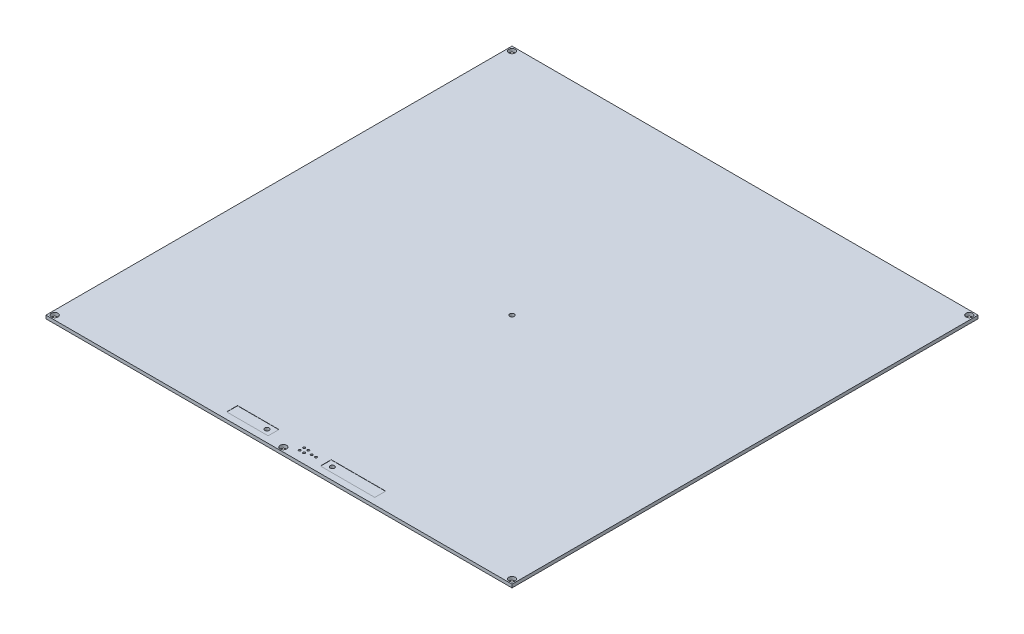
from build123d import *

# Parameters (mm, degrees)
SKIZZE1_W                       = 214
SKIZZE1_H                       = 214
AUFSATZ_LINEAR_AUSTRAGEN1_DEPTH = 1.5
SKIZZE2_R                       = 1.5
SCHNITT_LINEAR_AUSTRAGEN1_DEPTH = 152.328285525
SPIEGELN2_COPY_1_SKETCH_R       = 1.5
SPIEGELN2_COPY_1_DEPTH          = 152.328285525
SKIZZE3_R                       = 1.5
SKIZZE3_R_2                     = 1
SKIZZE3_R_3                     = 0.5
SKIZZE3_R_4                     = 1.05
SCHNITT_LINEAR_AUSTRAGEN2_DEPTH = 152.328285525
SKIZZE4_W                       = 19.050649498
SKIZZE4_H                       = 5
SKIZZE4_W_2                     = 25
SCHNITT_LINEAR_AUSTRAGEN3_DEPTH = 0.1


with BuildPart() as part:
    # Skizze1 → Aufsatz-Linear austragen1 (new body)
    with BuildSketch(Plane(origin=(0, 0, 0), x_dir=(1, 0, 0), z_dir=(0, 1, 0))):
        Rectangle(SKIZZE1_W, SKIZZE1_H)
    extrude(amount=AUFSATZ_LINEAR_AUSTRAGEN1_DEPTH)

    # Skizze2 → Schnitt-Linear austragen1 (cut, through all)
    with BuildSketch(Plane(origin=(0, 1.5, 0), x_dir=(1, 0, 0), z_dir=(0, 1, 0))):
        with Locations(Location((-105, 105, 0), (0, 0, 270))):
            Circle(SKIZZE2_R)
    schnitt_linear_austragen1 = extrude(amount=-SCHNITT_LINEAR_AUSTRAGEN1_DEPTH, mode=Mode.SUBTRACT)

    # Spiegeln1: Schnitt-Linear austragen1 across plane
    add(schnitt_linear_austragen1.mirror(Plane.XY), mode=Mode.SUBTRACT)

    # Spiegeln2: Schnitt-Linear austragen1 across plane
    add(schnitt_linear_austragen1.mirror(Plane(origin=(0, 0, 0), x_dir=(0, 0, 1), z_dir=(1, 0, 0))), mode=Mode.SUBTRACT)

    # Spiegeln2 copy 1 sketch → Spiegeln2 copy 1 (cut, through all)
    with BuildSketch(Plane(origin=(0, 1.5, 0), x_dir=(-1, 0, 0), z_dir=(0, 1, 0))):
        with Locations(Location((-105, 105, 0), (0, 0, 270))):
            Circle(SPIEGELN2_COPY_1_SKETCH_R)
    extrude(amount=-SPIEGELN2_COPY_1_DEPTH, mode=Mode.SUBTRACT)

    # Skizze3 → Schnitt-Linear austragen2 (cut, through all)
    with BuildSketch(Plane(origin=(0, 1.5, 0), x_dir=(1, 0, 0), z_dir=(0, 1, 0))):
        with Locations(Location((0, -105, 0), (0, 0, 270))):
            Circle(SKIZZE3_R)
        with Locations(Location((-11, -101.5, 0), (0, 0, 270))):
            Circle(SKIZZE3_R_2)
        with Locations(Location((19, -101.5, 0), (0, 0, 270))):
            Circle(SKIZZE3_R_2)
        with Locations(Location((5, -100.5, 0), (0, 0, 270))):
            Circle(SKIZZE3_R_3)
        with Locations(Location((5, -102.5, 0), (0, 0, 270))):
            Circle(SKIZZE3_R_3)
        with Locations(Location((7, -100.5, 0), (0, 0, 270))):
            Circle(SKIZZE3_R_3)
        with Locations(Location((7, -102.5, 0), (0, 0, 270))):
            Circle(SKIZZE3_R_3)
        with Locations(Location((9.5, -101.5, 0), (0, 0, 270))):
            Circle(SKIZZE3_R_3)
        with Locations(Location((11.5, -101.5, 0), (0, 0, 270))):
            Circle(SKIZZE3_R_3)
        with Locations(Location((0, 0, 0), (0, 0, 270))):
            Circle(SKIZZE3_R_4)
    extrude(amount=-SCHNITT_LINEAR_AUSTRAGEN2_DEPTH, mode=Mode.SUBTRACT)

    # Skizze4 → Schnitt-Linear austragen3 (cut)
    with BuildSketch(Plane(origin=(0, 1.5, 0), x_dir=(1, 0, 0), z_dir=(0, 1, 0))):
        with Locations((-17.525324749, -101.5)):
            Rectangle(SKIZZE4_W, SKIZZE4_H)
        with Locations((28.5, -101.5)):
            Rectangle(SKIZZE4_W_2, SKIZZE4_H)
    extrude(amount=-SCHNITT_LINEAR_AUSTRAGEN3_DEPTH, mode=Mode.SUBTRACT)


solid = part.part
